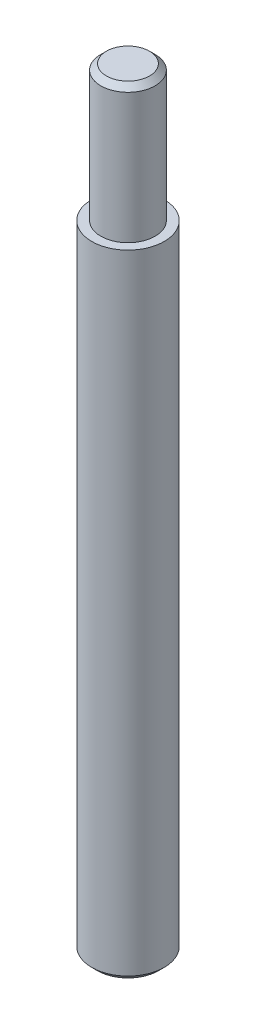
ISO-10303-21;
HEADER;
FILE_DESCRIPTION(('STEP AP214'),'2;1');
FILE_NAME('part.step','',(''),(''),'','','');
FILE_SCHEMA(('AUTOMOTIVE_DESIGN { 1 0 10303 214 1 1 1 1 }'));
ENDSEC;
DATA;
#1=APPLICATION_CONTEXT('core data for automotive mechanical design processes');
#2=APPLICATION_PROTOCOL_DEFINITION('international standard','automotive_design',2000,#1);
#3=PRODUCT_CONTEXT('',#1,'mechanical');
#4=PRODUCT('Part','Part','',(#3));
#5=PRODUCT_RELATED_PRODUCT_CATEGORY('part','',(#4));
#6=PRODUCT_DEFINITION_FORMATION('','',#4);
#7=PRODUCT_DEFINITION_CONTEXT('part definition',#1,'design');
#8=PRODUCT_DEFINITION('design','',#6,#7);
#9=PRODUCT_DEFINITION_SHAPE('','',#8);
#10=(LENGTH_UNIT() NAMED_UNIT(*) SI_UNIT(.MILLI.,.METRE.));
#11=(NAMED_UNIT(*) PLANE_ANGLE_UNIT() SI_UNIT($,.RADIAN.));
#12=(NAMED_UNIT(*) SI_UNIT($,.STERADIAN.) SOLID_ANGLE_UNIT());
#13=UNCERTAINTY_MEASURE_WITH_UNIT(LENGTH_MEASURE(1.E-05),#10,'distance_accuracy_value','');
#14=(GEOMETRIC_REPRESENTATION_CONTEXT(3) GLOBAL_UNCERTAINTY_ASSIGNED_CONTEXT((#13)) GLOBAL_UNIT_ASSIGNED_CONTEXT((#10,
#11,#12)) REPRESENTATION_CONTEXT('',''));
#15=CARTESIAN_POINT('',(0.,0.,0.));
#16=DIRECTION('',(0.,0.,1.));
#17=DIRECTION('',(1.,0.,0.));
#18=AXIS2_PLACEMENT_3D('',#15,#16,#17);
#19=CARTESIAN_POINT('',(0.,85.,0.));
#20=DIRECTION('',(0.,-1.,0.));
#21=DIRECTION('',(0.,0.,-1.));
#22=AXIS2_PLACEMENT_3D('',#19,#20,#21);
#23=CYLINDRICAL_SURFACE('',#22,4.);
#24=CARTESIAN_POINT('',(0.,0.624999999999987,0.));
#25=DIRECTION('',(0.,1.,0.));
#26=DIRECTION('',(0.,0.,1.));
#27=AXIS2_PLACEMENT_3D('',#24,#25,#26);
#28=CIRCLE('',#27,4.);
#29=CARTESIAN_POINT('',(0.,0.624999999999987,4.));
#30=VERTEX_POINT('',#29);
#31=EDGE_CURVE('E47',#30,#30,#28,.T.);
#32=ORIENTED_EDGE('',*,*,#31,.T.);
#33=EDGE_LOOP('',(#32));
#34=FACE_BOUND('',#33,.T.);
#35=CARTESIAN_POINT('',(0.,70.,0.));
#36=DIRECTION('',(0.,1.,0.));
#37=DIRECTION('',(0.,0.,1.));
#38=AXIS2_PLACEMENT_3D('',#35,#36,#37);
#39=CIRCLE('',#38,4.);
#40=CARTESIAN_POINT('',(0.,70.,4.));
#41=VERTEX_POINT('',#40);
#42=EDGE_CURVE('E50',#41,#41,#39,.T.);
#43=ORIENTED_EDGE('',*,*,#42,.F.);
#44=EDGE_LOOP('',(#43));
#45=FACE_BOUND('',#44,.T.);
#46=ADVANCED_FACE('F32',(#34,#45),#23,.T.);
#47=CARTESIAN_POINT('',(0.,0.,0.));
#48=DIRECTION('',(0.,1.,0.));
#49=DIRECTION('',(0.,0.,1.));
#50=AXIS2_PLACEMENT_3D('',#47,#48,#49);
#51=PLANE('',#50);
#52=CARTESIAN_POINT('',(0.,0.,0.));
#53=DIRECTION('',(0.,1.,0.));
#54=DIRECTION('',(0.,0.,1.));
#55=AXIS2_PLACEMENT_3D('',#52,#53,#54);
#56=CIRCLE('',#55,3.37500000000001);
#57=CARTESIAN_POINT('',(0.,0.,3.37500000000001));
#58=VERTEX_POINT('',#57);
#59=EDGE_CURVE('E43',#58,#58,#56,.F.);
#60=ORIENTED_EDGE('',*,*,#59,.T.);
#61=EDGE_LOOP('',(#60));
#62=FACE_BOUND('',#61,.T.);
#63=ADVANCED_FACE('F69',(#62),#51,.F.);
#64=CARTESIAN_POINT('',(0.,0.624999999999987,0.));
#65=DIRECTION('',(0.,1.,0.));
#66=DIRECTION('',(0.,0.,1.));
#67=AXIS2_PLACEMENT_3D('',#64,#65,#66);
#68=CONICAL_SURFACE('',#67,4.,0.785398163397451);
#69=ORIENTED_EDGE('',*,*,#59,.F.);
#70=EDGE_LOOP('',(#69));
#71=FACE_BOUND('',#70,.T.);
#72=ORIENTED_EDGE('',*,*,#31,.F.);
#73=EDGE_LOOP('',(#72));
#74=FACE_BOUND('',#73,.T.);
#75=ADVANCED_FACE('F64',(#71,#74),#68,.T.);
#76=CARTESIAN_POINT('',(0.,70.,0.));
#77=DIRECTION('',(0.,1.,0.));
#78=DIRECTION('',(0.,0.,1.));
#79=AXIS2_PLACEMENT_3D('',#76,#77,#78);
#80=PLANE('',#79);
#81=CARTESIAN_POINT('',(0.,70.,0.));
#82=DIRECTION('',(0.,1.,0.));
#83=DIRECTION('',(0.,0.,1.));
#84=AXIS2_PLACEMENT_3D('',#81,#82,#83);
#85=CIRCLE('',#84,3.);
#86=CARTESIAN_POINT('',(0.,70.,3.));
#87=VERTEX_POINT('',#86);
#88=EDGE_CURVE('E52',#87,#87,#85,.T.);
#89=ORIENTED_EDGE('',*,*,#88,.F.);
#90=EDGE_LOOP('',(#89));
#91=FACE_BOUND('',#90,.T.);
#92=ORIENTED_EDGE('',*,*,#42,.T.);
#93=EDGE_LOOP('',(#92));
#94=FACE_BOUND('',#93,.T.);
#95=ADVANCED_FACE('F61',(#91,#94),#80,.T.);
#96=CARTESIAN_POINT('',(0.,70.,0.));
#97=DIRECTION('',(0.,1.,0.));
#98=DIRECTION('',(0.,0.,1.));
#99=AXIS2_PLACEMENT_3D('',#96,#97,#98);
#100=CYLINDRICAL_SURFACE('',#99,3.);
#101=CARTESIAN_POINT('',(0.,84.375,0.));
#102=DIRECTION('',(0.,1.,0.));
#103=DIRECTION('',(0.,0.,1.));
#104=AXIS2_PLACEMENT_3D('',#101,#102,#103);
#105=CIRCLE('',#104,3.);
#106=CARTESIAN_POINT('',(0.,84.375,3.));
#107=VERTEX_POINT('',#106);
#108=EDGE_CURVE('E10',#107,#107,#105,.F.);
#109=ORIENTED_EDGE('',*,*,#108,.T.);
#110=EDGE_LOOP('',(#109));
#111=FACE_BOUND('',#110,.T.);
#112=ORIENTED_EDGE('',*,*,#88,.T.);
#113=EDGE_LOOP('',(#112));
#114=FACE_BOUND('',#113,.T.);
#115=ADVANCED_FACE('F59',(#111,#114),#100,.T.);
#116=CARTESIAN_POINT('',(0.,85.,0.));
#117=DIRECTION('',(0.,1.,0.));
#118=DIRECTION('',(0.,0.,1.));
#119=AXIS2_PLACEMENT_3D('',#116,#117,#118);
#120=PLANE('',#119);
#121=CARTESIAN_POINT('',(0.,85.,0.));
#122=DIRECTION('',(0.,1.,0.));
#123=DIRECTION('',(0.,0.,1.));
#124=AXIS2_PLACEMENT_3D('',#121,#122,#123);
#125=CIRCLE('',#124,2.375);
#126=CARTESIAN_POINT('',(0.,85.,2.375));
#127=VERTEX_POINT('',#126);
#128=EDGE_CURVE('E39',#127,#127,#125,.T.);
#129=ORIENTED_EDGE('',*,*,#128,.T.);
#130=EDGE_LOOP('',(#129));
#131=FACE_BOUND('',#130,.T.);
#132=ADVANCED_FACE('F98',(#131),#120,.T.);
#133=CARTESIAN_POINT('',(0.,85.,0.));
#134=DIRECTION('',(0.,-1.,0.));
#135=DIRECTION('',(0.,0.,-1.));
#136=AXIS2_PLACEMENT_3D('',#133,#134,#135);
#137=CONICAL_SURFACE('',#136,2.375,0.785398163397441);
#138=ORIENTED_EDGE('',*,*,#108,.F.);
#139=EDGE_LOOP('',(#138));
#140=FACE_BOUND('',#139,.T.);
#141=ORIENTED_EDGE('',*,*,#128,.F.);
#142=EDGE_LOOP('',(#141));
#143=FACE_BOUND('',#142,.T.);
#144=ADVANCED_FACE('F34',(#140,#143),#137,.T.);
#145=CLOSED_SHELL('',(#46,#63,#75,#95,#115,#132,#144));
#146=MANIFOLD_SOLID_BREP('B2',#145);
#147=ADVANCED_BREP_SHAPE_REPRESENTATION('',(#18,#146),#14);
#148=SHAPE_DEFINITION_REPRESENTATION(#9,#147);
ENDSEC;
END-ISO-10303-21;
